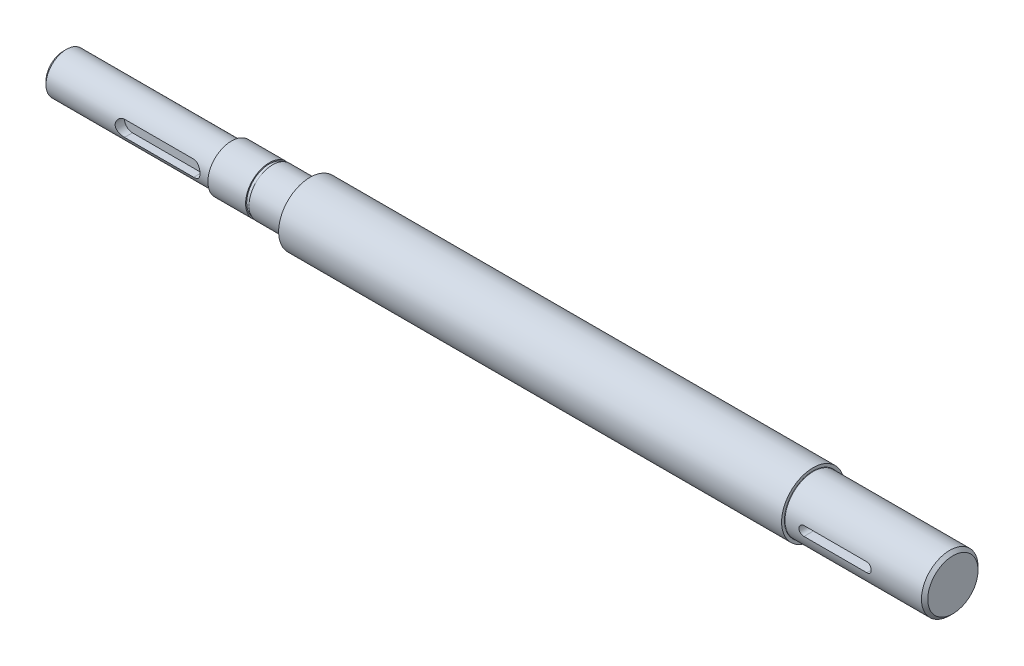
from build123d import *

# Parameters (mm, degrees)
CORTAR_EXTRUIR1_DEPTH = 3.5
CORTAR_EXTRUIR2_DEPTH = 3.5
CHAFL_N1_SIZE         = 1
REDONDEO1_R           = 0.1


with BuildPart() as part:
    # Croquis1 → Revoluci_n1 (revolve)
    with BuildSketch(Plane.XY, mode=Mode.PRIVATE) as revoluci_n1_sk:
        with BuildLine():
            Line((0, 0), (0, 6.5))
            Line((0, 6.5), (53.5, 6.5))
            Line((53.5, 6.5), (53.5, 7.5))
            Line((53.5, 7.5), (65.5, 7.5))
            Line((65.5, 7.5), (65.5, 7.15))
            Line((65.5, 7.15), (66.6, 7.15))
            Line((66.6, 7.15), (66.6, 7.5))
            Line((66.6, 7.5), (78.1, 7.5))
            ThreePointArc((78.1, 7.5), (78.382842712, 7.617157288), (78.5, 7.9))
            Line((78.5, 7.9), (78.5, 10))
            Line((78.5, 10), (238.5, 10))
            Line((238.5, 10), (238.5, 9))
            Line((238.5, 9), (283, 9))
            Line((283, 9), (283, 0))
            Line((283, 0), (0, 0))
        make_face()
    revolve(revoluci_n1_sk.sketch.rotate(Axis((0, 0, 0), (1, 0, 0)), 90), axis=Axis((0, 0, 0), (1, 0, 0)))

    # Croquis3 → Cortar-Extruir1 (cut)
    with BuildSketch(Plane.XY.offset(7)):
        with BuildLine():
            Line((25.5, 2.5), (47.5, 2.5))
            ThreePointArc((47.5, 2.5), (50, 0), (47.5, -2.5))
            Line((47.5, -2.5), (25.5, -2.5))
            ThreePointArc((25.5, -2.5), (23, 0), (25.5, 2.5))
        make_face()
    extrude(amount=-CORTAR_EXTRUIR1_DEPTH, mode=Mode.SUBTRACT)

    # Croquis4 → Cortar-Extruir2 (cut)
    with BuildSketch(Plane.XY.offset(9)):
        with BuildLine():
            Line((244.5, 1.5), (264.5, 1.5))
            ThreePointArc((264.5, 1.5), (266, 0), (264.5, -1.5))
            Line((264.5, -1.5), (244.5, -1.5))
            ThreePointArc((244.5, -1.5), (243, 0), (244.5, 1.5))
        make_face()
    extrude(amount=-CORTAR_EXTRUIR2_DEPTH, mode=Mode.SUBTRACT)

    # Chafl_n1
    chafl_n1_edges = [part.edges().sort_by_distance(p)[0] for p in [
        (283, 0, -9),
        (0, 0, -6.5),
    ]]
    chamfer(chafl_n1_edges, length=CHAFL_N1_SIZE)

    # Redondeo1
    redondeo1_edges = [part.edges().sort_by_distance(p)[0] for p in [
        (238.5, 0, -9),
        (53.5, 0, -6.5),
    ]]
    fillet(redondeo1_edges, radius=REDONDEO1_R)


solid = part.part
